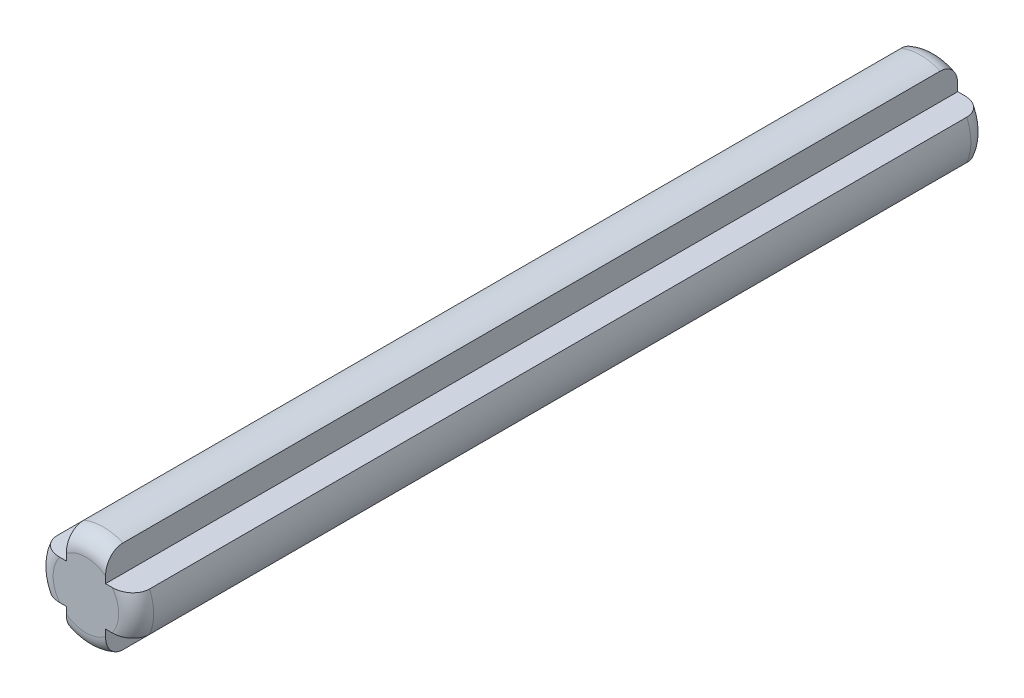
ISO-10303-21;
HEADER;
FILE_DESCRIPTION(('STEP AP214'),'2;1');
FILE_NAME('part.step','',(''),(''),'','','');
FILE_SCHEMA(('AUTOMOTIVE_DESIGN { 1 0 10303 214 1 1 1 1 }'));
ENDSEC;
DATA;
#1=APPLICATION_CONTEXT('core data for automotive mechanical design processes');
#2=APPLICATION_PROTOCOL_DEFINITION('international standard','automotive_design',2000,#1);
#3=PRODUCT_CONTEXT('',#1,'mechanical');
#4=PRODUCT('Part','Part','',(#3));
#5=PRODUCT_RELATED_PRODUCT_CATEGORY('part','',(#4));
#6=PRODUCT_DEFINITION_FORMATION('','',#4);
#7=PRODUCT_DEFINITION_CONTEXT('part definition',#1,'design');
#8=PRODUCT_DEFINITION('design','',#6,#7);
#9=PRODUCT_DEFINITION_SHAPE('','',#8);
#10=(LENGTH_UNIT() NAMED_UNIT(*) SI_UNIT(.MILLI.,.METRE.));
#11=(NAMED_UNIT(*) PLANE_ANGLE_UNIT() SI_UNIT($,.RADIAN.));
#12=(NAMED_UNIT(*) SI_UNIT($,.STERADIAN.) SOLID_ANGLE_UNIT());
#13=UNCERTAINTY_MEASURE_WITH_UNIT(LENGTH_MEASURE(1.E-05),#10,'distance_accuracy_value','');
#14=(GEOMETRIC_REPRESENTATION_CONTEXT(3) GLOBAL_UNCERTAINTY_ASSIGNED_CONTEXT((#13)) GLOBAL_UNIT_ASSIGNED_CONTEXT((#10,
#11,#12)) REPRESENTATION_CONTEXT('',''));
#15=CARTESIAN_POINT('',(0.,0.,0.));
#16=DIRECTION('',(0.,0.,1.));
#17=DIRECTION('',(1.,0.,0.));
#18=AXIS2_PLACEMENT_3D('',#15,#16,#17);
#19=CARTESIAN_POINT('',(0.899999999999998,0.,-39.));
#20=DIRECTION('',(-1.,0.,0.));
#21=DIRECTION('',(0.,0.,0.999999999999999));
#22=AXIS2_PLACEMENT_3D('',#19,#20,#21);
#23=PLANE('',#22);
#24=DIRECTION('',(0.,-1.,0.));
#25=VECTOR('',#24,1.);
#26=CARTESIAN_POINT('',(0.899999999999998,0.,-39.));
#27=LINE('',#26,#25);
#28=CARTESIAN_POINT('',(0.900000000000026,1.2,-39.));
#29=VERTEX_POINT('',#28);
#30=CARTESIAN_POINT('',(0.900000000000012,0.899999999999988,-39.));
#31=VERTEX_POINT('',#30);
#32=EDGE_CURVE('E218',#29,#31,#27,.T.);
#33=ORIENTED_EDGE('',*,*,#32,.F.);
#34=CARTESIAN_POINT('',(0.900000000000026,1.2,-39.));
#35=CARTESIAN_POINT('',(0.900000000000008,1.23177264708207,-38.9999988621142));
#36=CARTESIAN_POINT('',(0.900000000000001,1.2635373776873,-38.9987861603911));
#37=CARTESIAN_POINT('',(0.899999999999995,1.32690893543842,-38.9937439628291));
#38=CARTESIAN_POINT('',(0.899999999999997,1.35851541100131,-38.9899101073));
#39=CARTESIAN_POINT('',(0.9,1.45291091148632,-38.9741597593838));
#40=CARTESIAN_POINT('',(0.9,1.51508424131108,-38.9579921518));
#41=CARTESIAN_POINT('',(0.899999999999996,1.62122301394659,-38.9186762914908));
#42=CARTESIAN_POINT('',(0.899999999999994,1.66610240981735,-38.8979677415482));
#43=CARTESIAN_POINT('',(0.900000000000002,1.7517430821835,-38.8494286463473));
#44=CARTESIAN_POINT('',(0.900000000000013,1.79251387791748,-38.8216151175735));
#45=CARTESIAN_POINT('',(0.900000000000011,1.8687569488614,-38.7590609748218));
#46=CARTESIAN_POINT('',(0.899999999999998,1.90419849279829,-38.7242826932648));
#47=CARTESIAN_POINT('',(0.899999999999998,1.96804173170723,-38.6487024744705));
#48=CARTESIAN_POINT('',(0.900000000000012,1.99643996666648,-38.607897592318));
#49=CARTESIAN_POINT('',(0.900000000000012,2.0426342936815,-38.5255349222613));
#50=CARTESIAN_POINT('',(0.900000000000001,2.06116131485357,-38.4843855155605));
#51=CARTESIAN_POINT('',(0.899999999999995,2.09051404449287,-38.3994647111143));
#52=CARTESIAN_POINT('',(0.899999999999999,2.10135386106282,-38.3556982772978));
#53=CARTESIAN_POINT('',(0.899999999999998,2.11095369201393,-38.292930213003));
#54=CARTESIAN_POINT('',(0.899999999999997,2.11307132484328,-38.2743928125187));
#55=CARTESIAN_POINT('',(0.899999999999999,2.11589349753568,-38.2372401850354));
#56=CARTESIAN_POINT('',(0.900000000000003,2.11660026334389,-38.2186251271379));
#57=CARTESIAN_POINT('',(0.900000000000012,2.11660104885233,-38.2000000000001));
#58=B_SPLINE_CURVE_WITH_KNOTS('',3,(#34,#35,#36,#37,#38,#39,#40,#41,#42,#43,#44,#45,#46,#47,#48,
#49,#50,#51,#52,#53,#54,#55,#56,#57),.UNSPECIFIED.,.F.,.F.,(4,2,2,2,2,2,2,2,2,2,2,4),(0.,
0.0952699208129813,0.190698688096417,0.382124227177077,0.529802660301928,0.677130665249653,
0.825278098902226,0.973498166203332,1.10819470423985,1.24264339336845,1.29857368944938,
1.35441567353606),.UNSPECIFIED.);
#59=CARTESIAN_POINT('',(0.900000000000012,2.11660104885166,-38.2));
#60=VERTEX_POINT('',#59);
#61=EDGE_CURVE('E413',#29,#60,#58,.T.);
#62=ORIENTED_EDGE('',*,*,#61,.T.);
#63=DIRECTION('',(0.,0.,0.999999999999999));
#64=VECTOR('',#63,1.);
#65=CARTESIAN_POINT('',(0.900000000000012,2.11660104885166,-39.));
#66=LINE('',#65,#64);
#67=CARTESIAN_POINT('',(0.899999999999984,2.11660104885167,-0.800000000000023));
#68=VERTEX_POINT('',#67);
#69=EDGE_CURVE('E256',#60,#68,#66,.T.);
#70=ORIENTED_EDGE('',*,*,#69,.T.);
#71=CARTESIAN_POINT('',(0.899999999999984,2.11660104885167,-0.800000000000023));
#72=CARTESIAN_POINT('',(0.899999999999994,2.11664820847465,-0.757867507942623));
#73=CARTESIAN_POINT('',(0.899999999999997,2.11298761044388,-0.715759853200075));
#74=CARTESIAN_POINT('',(0.899999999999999,2.09861504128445,-0.632869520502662));
#75=CARTESIAN_POINT('',(0.899999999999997,2.08792060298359,-0.592083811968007));
#76=CARTESIAN_POINT('',(0.899999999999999,2.05984193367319,-0.512893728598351));
#77=CARTESIAN_POINT('',(0.900000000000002,2.04245802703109,-0.474489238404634));
#78=CARTESIAN_POINT('',(0.899999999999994,2.00163237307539,-0.401044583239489));
#79=CARTESIAN_POINT('',(0.899999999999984,1.97818857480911,-0.366005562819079));
#80=CARTESIAN_POINT('',(0.899999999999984,1.92541056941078,-0.299327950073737));
#81=CARTESIAN_POINT('',(0.899999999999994,1.89594969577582,-0.267789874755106));
#82=CARTESIAN_POINT('',(0.900000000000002,1.83247761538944,-0.209727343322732));
#83=CARTESIAN_POINT('',(0.9,1.7984671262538,-0.183202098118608));
#84=CARTESIAN_POINT('',(0.899999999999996,1.72434385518,-0.133829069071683));
#85=CARTESIAN_POINT('',(0.899999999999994,1.6839694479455,-0.111374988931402));
#86=CARTESIAN_POINT('',(0.900000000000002,1.60027120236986,-0.0727387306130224));
#87=CARTESIAN_POINT('',(0.900000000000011,1.55694210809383,-0.056568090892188));
#88=CARTESIAN_POINT('',(0.900000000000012,1.46195018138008,-0.028495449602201));
#89=CARTESIAN_POINT('',(0.900000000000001,1.40999804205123,-0.0175692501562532));
#90=CARTESIAN_POINT('',(0.899999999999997,1.33146710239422,-0.00688571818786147));
#91=CARTESIAN_POINT('',(0.899999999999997,1.30523100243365,-0.00427515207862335));
#92=CARTESIAN_POINT('',(0.899999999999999,1.25266468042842,-0.000833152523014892));
#93=CARTESIAN_POINT('',(0.899999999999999,1.22633456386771,-1.25965912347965E-07));
#94=CARTESIAN_POINT('',(0.899999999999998,1.19999999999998,0.));
#95=B_SPLINE_CURVE_WITH_KNOTS('',3,(#71,#72,#73,#74,#75,#76,#77,#78,#79,#80,#81,#82,#83,#84,#85,
#86,#87,#88,#89,#90,#91,#92,#93,#94),.UNSPECIFIED.,.F.,.F.,(4,2,2,2,2,2,2,2,2,2,2,4),(0.,
0.126200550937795,0.252087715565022,0.377968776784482,0.503892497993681,0.632806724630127,
0.761700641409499,0.899726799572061,1.03800523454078,1.19659344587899,1.27564166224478,
1.35461900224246),.UNSPECIFIED.);
#96=CARTESIAN_POINT('',(0.899999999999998,1.19999999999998,0.));
#97=VERTEX_POINT('',#96);
#98=EDGE_CURVE('E421',#68,#97,#95,.T.);
#99=ORIENTED_EDGE('',*,*,#98,.T.);
#100=DIRECTION('',(0.,-1.,0.));
#101=VECTOR('',#100,1.);
#102=CARTESIAN_POINT('',(0.899999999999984,0.,0.));
#103=LINE('',#102,#101);
#104=CARTESIAN_POINT('',(0.900000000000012,0.900000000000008,0.));
#105=VERTEX_POINT('',#104);
#106=EDGE_CURVE('E257',#97,#105,#103,.T.);
#107=ORIENTED_EDGE('',*,*,#106,.T.);
#108=DIRECTION('',(0.,0.,0.999999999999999));
#109=VECTOR('',#108,1.);
#110=CARTESIAN_POINT('',(0.900000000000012,0.899999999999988,-39.));
#111=LINE('',#110,#109);
#112=EDGE_CURVE('E283',#31,#105,#111,.T.);
#113=ORIENTED_EDGE('',*,*,#112,.F.);
#114=EDGE_LOOP('',(#33,#62,#70,#99,#107,#113));
#115=FACE_BOUND('',#114,.T.);
#116=ADVANCED_FACE('F59',(#115),#23,.F.);
#117=CARTESIAN_POINT('',(0.,0.899999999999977,-39.));
#118=DIRECTION('',(0.,-1.,0.));
#119=DIRECTION('',(0.,0.,-0.999999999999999));
#120=AXIS2_PLACEMENT_3D('',#117,#118,#119);
#121=PLANE('',#120);
#122=DIRECTION('',(0.,0.,0.999999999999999));
#123=VECTOR('',#122,1.);
#124=CARTESIAN_POINT('',(2.11660104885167,0.899999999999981,-39.));
#125=LINE('',#124,#123);
#126=CARTESIAN_POINT('',(2.11660104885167,0.899999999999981,-38.2));
#127=VERTEX_POINT('',#126);
#128=CARTESIAN_POINT('',(2.11660104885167,0.899999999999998,-0.800000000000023));
#129=VERTEX_POINT('',#128);
#130=EDGE_CURVE('E288',#127,#129,#125,.T.);
#131=ORIENTED_EDGE('',*,*,#130,.F.);
#132=CARTESIAN_POINT('',(2.11660104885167,0.899999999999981,-38.2));
#133=CARTESIAN_POINT('',(2.11664820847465,0.89999999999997,-38.2421324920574));
#134=CARTESIAN_POINT('',(2.11298761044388,0.899999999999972,-38.2842401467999));
#135=CARTESIAN_POINT('',(2.09861504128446,0.899999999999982,-38.3671304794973));
#136=CARTESIAN_POINT('',(2.08792060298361,0.899999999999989,-38.407916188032));
#137=CARTESIAN_POINT('',(2.05984193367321,0.899999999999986,-38.4871062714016));
#138=CARTESIAN_POINT('',(2.04245802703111,0.899999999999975,-38.5255107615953));
#139=CARTESIAN_POINT('',(2.0016323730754,0.899999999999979,-38.5989554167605));
#140=CARTESIAN_POINT('',(1.97818857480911,0.899999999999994,-38.6339944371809));
#141=CARTESIAN_POINT('',(1.92541056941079,0.899999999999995,-38.7006720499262));
#142=CARTESIAN_POINT('',(1.89594969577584,0.899999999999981,-38.7322101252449));
#143=CARTESIAN_POINT('',(1.83247761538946,0.899999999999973,-38.7902726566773));
#144=CARTESIAN_POINT('',(1.7984671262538,0.899999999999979,-38.8167979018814));
#145=CARTESIAN_POINT('',(1.72434385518,0.899999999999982,-38.8661709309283));
#146=CARTESIAN_POINT('',(1.68396944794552,0.899999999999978,-38.8886250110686));
#147=CARTESIAN_POINT('',(1.60027120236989,0.899999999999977,-38.927261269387));
#148=CARTESIAN_POINT('',(1.55694210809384,0.89999999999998,-38.9434319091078));
#149=CARTESIAN_POINT('',(1.4619501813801,0.899999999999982,-38.9715045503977));
#150=CARTESIAN_POINT('',(1.40999804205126,0.899999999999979,-38.9824307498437));
#151=CARTESIAN_POINT('',(1.33146710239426,0.899999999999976,-38.9931142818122));
#152=CARTESIAN_POINT('',(1.30523100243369,0.899999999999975,-38.9957248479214));
#153=CARTESIAN_POINT('',(1.25266468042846,0.899999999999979,-38.999166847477));
#154=CARTESIAN_POINT('',(1.22633456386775,0.899999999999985,-38.9999998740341));
#155=CARTESIAN_POINT('',(1.20000000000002,0.899999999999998,-39.));
#156=B_SPLINE_CURVE_WITH_KNOTS('',3,(#132,#133,#134,#135,#136,#137,#138,#139,#140,#141,#142,
#143,#144,#145,#146,#147,#148,#149,#150,#151,#152,#153,#154,#155),.UNSPECIFIED.,.F.,.F.,(4,2,2,
2,2,2,2,2,2,2,2,4),(0.,0.126200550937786,0.252087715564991,0.377968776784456,0.50389249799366,
0.63280672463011,0.76170064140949,0.89972679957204,1.03800523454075,1.19659344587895,
1.27564166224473,1.35461900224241),.UNSPECIFIED.);
#157=CARTESIAN_POINT('',(1.20000000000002,0.899999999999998,-39.));
#158=VERTEX_POINT('',#157);
#159=EDGE_CURVE('E339',#127,#158,#156,.T.);
#160=ORIENTED_EDGE('',*,*,#159,.T.);
#161=DIRECTION('',(1.,0.,0.));
#162=VECTOR('',#161,1.);
#163=CARTESIAN_POINT('',(0.,0.899999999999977,-39.));
#164=LINE('',#163,#162);
#165=EDGE_CURVE('E253',#31,#158,#164,.T.);
#166=ORIENTED_EDGE('',*,*,#165,.F.);
#167=ORIENTED_EDGE('',*,*,#112,.T.);
#168=DIRECTION('',(1.,0.,0.));
#169=VECTOR('',#168,1.);
#170=CARTESIAN_POINT('',(0.,0.900000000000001,0.));
#171=LINE('',#170,#169);
#172=CARTESIAN_POINT('',(1.19999999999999,0.900000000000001,0.));
#173=VERTEX_POINT('',#172);
#174=EDGE_CURVE('E279',#105,#173,#171,.T.);
#175=ORIENTED_EDGE('',*,*,#174,.T.);
#176=CARTESIAN_POINT('',(1.19999999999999,0.900000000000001,0.));
#177=CARTESIAN_POINT('',(1.23177264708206,0.899999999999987,-1.13788576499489E-06));
#178=CARTESIAN_POINT('',(1.26353737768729,0.89999999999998,-0.00121383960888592));
#179=CARTESIAN_POINT('',(1.32690893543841,0.899999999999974,-0.00625603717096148));
#180=CARTESIAN_POINT('',(1.3585154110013,0.899999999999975,-0.0100898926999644));
#181=CARTESIAN_POINT('',(1.45291091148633,0.899999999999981,-0.0258402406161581));
#182=CARTESIAN_POINT('',(1.5150842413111,0.899999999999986,-0.0420078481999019));
#183=CARTESIAN_POINT('',(1.6212230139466,0.899999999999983,-0.0813237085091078));
#184=CARTESIAN_POINT('',(1.66610240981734,0.899999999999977,-0.102032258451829));
#185=CARTESIAN_POINT('',(1.75174308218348,0.899999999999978,-0.150571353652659));
#186=CARTESIAN_POINT('',(1.79251387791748,0.899999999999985,-0.178384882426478));
#187=CARTESIAN_POINT('',(1.8687569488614,0.899999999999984,-0.24093902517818));
#188=CARTESIAN_POINT('',(1.90419849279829,0.899999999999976,-0.27571730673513));
#189=CARTESIAN_POINT('',(1.96804173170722,0.899999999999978,-0.351297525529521));
#190=CARTESIAN_POINT('',(1.99643996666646,0.899999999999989,-0.392102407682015));
#191=CARTESIAN_POINT('',(2.04263429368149,0.899999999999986,-0.474465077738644));
#192=CARTESIAN_POINT('',(2.06116131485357,0.899999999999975,-0.515614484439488));
#193=CARTESIAN_POINT('',(2.09051404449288,0.899999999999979,-0.600535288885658));
#194=CARTESIAN_POINT('',(2.10135386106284,0.899999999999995,-0.644301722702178));
#195=CARTESIAN_POINT('',(2.11095369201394,0.899999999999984,-0.707069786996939));
#196=CARTESIAN_POINT('',(2.11307132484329,0.899999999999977,-0.725607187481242));
#197=CARTESIAN_POINT('',(2.1158934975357,0.899999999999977,-0.762759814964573));
#198=CARTESIAN_POINT('',(2.11660026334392,0.899999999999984,-0.781374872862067));
#199=CARTESIAN_POINT('',(2.11660104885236,0.900000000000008,-0.799999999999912));
#200=B_SPLINE_CURVE_WITH_KNOTS('',3,(#176,#177,#178,#179,#180,#181,#182,#183,#184,#185,#186,
#187,#188,#189,#190,#191,#192,#193,#194,#195,#196,#197,#198,#199),.UNSPECIFIED.,.F.,.F.,(4,2,2,
2,2,2,2,2,2,2,2,4),(0.,0.0952699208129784,0.190698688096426,0.382124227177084,0.529802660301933,
0.677130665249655,0.825278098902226,0.973498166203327,1.10819470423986,1.24264339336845,
1.29857368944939,1.35441567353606),.UNSPECIFIED.);
#201=EDGE_CURVE('E330',#173,#129,#200,.T.);
#202=ORIENTED_EDGE('',*,*,#201,.T.);
#203=EDGE_LOOP('',(#131,#160,#166,#167,#175,#202));
#204=FACE_BOUND('',#203,.T.);
#205=ADVANCED_FACE('F349',(#204),#121,.F.);
#206=CARTESIAN_POINT('',(0.,0.,-39.));
#207=DIRECTION('',(0.,0.,0.999999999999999));
#208=DIRECTION('',(1.,0.,0.));
#209=AXIS2_PLACEMENT_3D('',#206,#207,#208);
#210=CYLINDRICAL_SURFACE('',#209,2.3);
#211=DIRECTION('',(0.,0.,0.999999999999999));
#212=VECTOR('',#211,1.);
#213=CARTESIAN_POINT('',(2.11660104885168,-0.900000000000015,-39.));
#214=LINE('',#213,#212);
#215=CARTESIAN_POINT('',(2.11660104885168,-0.900000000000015,-38.2));
#216=VERTEX_POINT('',#215);
#217=CARTESIAN_POINT('',(2.11660104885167,-0.900000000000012,-0.800000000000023));
#218=VERTEX_POINT('',#217);
#219=EDGE_CURVE('E292',#216,#218,#214,.T.);
#220=ORIENTED_EDGE('',*,*,#219,.F.);
#221=CARTESIAN_POINT('',(0.,0.,-38.2));
#222=DIRECTION('',(0.,0.,0.999999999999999));
#223=DIRECTION('',(1.,0.,0.));
#224=AXIS2_PLACEMENT_3D('',#221,#222,#223);
#225=CIRCLE('',#224,2.3);
#226=EDGE_CURVE('E326',#216,#127,#225,.T.);
#227=ORIENTED_EDGE('',*,*,#226,.T.);
#228=ORIENTED_EDGE('',*,*,#130,.T.);
#229=CARTESIAN_POINT('',(0.,0.,-0.800000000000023));
#230=DIRECTION('',(0.,0.,0.999999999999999));
#231=DIRECTION('',(1.,0.,0.));
#232=AXIS2_PLACEMENT_3D('',#229,#230,#231);
#233=CIRCLE('',#232,2.3);
#234=EDGE_CURVE('E287',#129,#218,#233,.F.);
#235=ORIENTED_EDGE('',*,*,#234,.T.);
#236=EDGE_LOOP('',(#220,#227,#228,#235));
#237=FACE_BOUND('',#236,.T.);
#238=ADVANCED_FACE('F354',(#237),#210,.T.);
#239=CARTESIAN_POINT('',(0.,-0.900000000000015,-39.));
#240=DIRECTION('',(0.,-1.,0.));
#241=DIRECTION('',(0.,0.,-0.999999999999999));
#242=AXIS2_PLACEMENT_3D('',#239,#240,#241);
#243=PLANE('',#242);
#244=DIRECTION('',(1.,0.,0.));
#245=VECTOR('',#244,1.);
#246=CARTESIAN_POINT('',(0.,-0.900000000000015,-39.));
#247=LINE('',#246,#245);
#248=CARTESIAN_POINT('',(0.899999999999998,-0.900000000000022,-39.));
#249=VERTEX_POINT('',#248);
#250=CARTESIAN_POINT('',(1.20000000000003,-0.900000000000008,-39.));
#251=VERTEX_POINT('',#250);
#252=EDGE_CURVE('E249',#249,#251,#247,.T.);
#253=ORIENTED_EDGE('',*,*,#252,.T.);
#254=CARTESIAN_POINT('',(1.20000000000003,-0.900000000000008,-39.));
#255=CARTESIAN_POINT('',(1.2317726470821,-0.900000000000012,-38.9999988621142));
#256=CARTESIAN_POINT('',(1.26353737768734,-0.900000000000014,-38.9987861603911));
#257=CARTESIAN_POINT('',(1.32690893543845,-0.900000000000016,-38.993743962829));
#258=CARTESIAN_POINT('',(1.35851541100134,-0.900000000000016,-38.9899101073));
#259=CARTESIAN_POINT('',(1.45291091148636,-0.900000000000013,-38.9741597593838));
#260=CARTESIAN_POINT('',(1.51508424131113,-0.900000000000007,-38.9579921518));
#261=CARTESIAN_POINT('',(1.62122301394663,-0.90000000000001,-38.9186762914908));
#262=CARTESIAN_POINT('',(1.66610240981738,-0.900000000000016,-38.8979677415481));
#263=CARTESIAN_POINT('',(1.75174308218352,-0.900000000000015,-38.8494286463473));
#264=CARTESIAN_POINT('',(1.79251387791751,-0.900000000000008,-38.8216151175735));
#265=CARTESIAN_POINT('',(1.86875694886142,-0.900000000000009,-38.7590609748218));
#266=CARTESIAN_POINT('',(1.9041984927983,-0.900000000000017,-38.7242826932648));
#267=CARTESIAN_POINT('',(1.96804173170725,-0.900000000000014,-38.6487024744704));
#268=CARTESIAN_POINT('',(1.99643996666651,-0.900000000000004,-38.607897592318));
#269=CARTESIAN_POINT('',(2.04263429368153,-0.900000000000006,-38.5255349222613));
#270=CARTESIAN_POINT('',(2.06116131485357,-0.900000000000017,-38.4843855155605));
#271=CARTESIAN_POINT('',(2.09051404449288,-0.900000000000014,-38.3994647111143));
#272=CARTESIAN_POINT('',(2.10135386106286,-0.9,-38.3556982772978));
#273=CARTESIAN_POINT('',(2.11095369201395,-0.900000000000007,-38.292930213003));
#274=CARTESIAN_POINT('',(2.11307132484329,-0.900000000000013,-38.2743928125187));
#275=CARTESIAN_POINT('',(2.11589349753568,-0.900000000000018,-38.2372401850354));
#276=CARTESIAN_POINT('',(2.1166002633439,-0.900000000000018,-38.2186251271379));
#277=CARTESIAN_POINT('',(2.11660104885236,-0.900000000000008,-38.2000000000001));
#278=B_SPLINE_CURVE_WITH_KNOTS('',3,(#254,#255,#256,#257,#258,#259,#260,#261,#262,#263,#264,
#265,#266,#267,#268,#269,#270,#271,#272,#273,#274,#275,#276,#277),.UNSPECIFIED.,.F.,.F.,(4,2,2,
2,2,2,2,2,2,2,2,4),(0.,0.0952699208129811,0.190698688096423,0.382124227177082,0.529802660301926,
0.677130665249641,0.825278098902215,0.973498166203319,1.10819470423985,1.24264339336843,
1.29857368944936,1.35441567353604),.UNSPECIFIED.);
#279=EDGE_CURVE('E380',#251,#216,#278,.T.);
#280=ORIENTED_EDGE('',*,*,#279,.T.);
#281=ORIENTED_EDGE('',*,*,#219,.T.);
#282=CARTESIAN_POINT('',(2.11660104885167,-0.900000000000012,-0.800000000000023));
#283=CARTESIAN_POINT('',(2.11664820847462,-0.900000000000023,-0.757867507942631));
#284=CARTESIAN_POINT('',(2.11298761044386,-0.90000000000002,-0.71575985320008));
#285=CARTESIAN_POINT('',(2.09861504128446,-0.90000000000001,-0.632869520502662));
#286=CARTESIAN_POINT('',(2.08792060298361,-0.900000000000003,-0.592083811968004));
#287=CARTESIAN_POINT('',(2.05984193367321,-0.900000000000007,-0.512893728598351));
#288=CARTESIAN_POINT('',(2.04245802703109,-0.900000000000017,-0.474489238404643));
#289=CARTESIAN_POINT('',(2.00163237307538,-0.900000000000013,-0.401044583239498));
#290=CARTESIAN_POINT('',(1.97818857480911,-0.899999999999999,-0.366005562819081));
#291=CARTESIAN_POINT('',(1.92541056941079,-0.899999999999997,-0.299327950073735));
#292=CARTESIAN_POINT('',(1.89594969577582,-0.900000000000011,-0.267789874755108));
#293=CARTESIAN_POINT('',(1.83247761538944,-0.90000000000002,-0.209727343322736));
#294=CARTESIAN_POINT('',(1.7984671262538,-0.900000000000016,-0.183202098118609));
#295=CARTESIAN_POINT('',(1.72434385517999,-0.900000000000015,-0.133829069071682));
#296=CARTESIAN_POINT('',(1.68396944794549,-0.900000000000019,-0.111374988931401));
#297=CARTESIAN_POINT('',(1.60027120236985,-0.900000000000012,-0.0727387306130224));
#298=CARTESIAN_POINT('',(1.55694210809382,-0.900000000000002,-0.0565680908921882));
#299=CARTESIAN_POINT('',(1.46195018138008,-0.9,-0.0284954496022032));
#300=CARTESIAN_POINT('',(1.40999804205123,-0.900000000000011,-0.0175692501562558));
#301=CARTESIAN_POINT('',(1.33146710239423,-0.900000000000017,-0.00688571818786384));
#302=CARTESIAN_POINT('',(1.30523100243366,-0.900000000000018,-0.00427515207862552));
#303=CARTESIAN_POINT('',(1.25266468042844,-0.900000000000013,-0.000833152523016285));
#304=CARTESIAN_POINT('',(1.22633456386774,-0.900000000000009,-1.25965913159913E-07));
#305=CARTESIAN_POINT('',(1.20000000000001,-0.900000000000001,0.));
#306=B_SPLINE_CURVE_WITH_KNOTS('',3,(#282,#283,#284,#285,#286,#287,#288,#289,#290,#291,#292,
#293,#294,#295,#296,#297,#298,#299,#300,#301,#302,#303,#304,#305),.UNSPECIFIED.,.F.,.F.,(4,2,2,
2,2,2,2,2,2,2,2,4),(0.,0.126200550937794,0.252087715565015,0.377968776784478,0.503892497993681,
0.632806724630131,0.761700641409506,0.89972679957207,1.03800523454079,1.19659344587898,
1.27564166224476,1.35461900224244),.UNSPECIFIED.);
#307=CARTESIAN_POINT('',(1.20000000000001,-0.900000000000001,0.));
#308=VERTEX_POINT('',#307);
#309=EDGE_CURVE('E373',#218,#308,#306,.T.);
#310=ORIENTED_EDGE('',*,*,#309,.T.);
#311=DIRECTION('',(1.,0.,0.));
#312=VECTOR('',#311,1.);
#313=CARTESIAN_POINT('',(0.,-0.900000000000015,0.));
#314=LINE('',#313,#312);
#315=CARTESIAN_POINT('',(0.899999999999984,-0.900000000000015,0.));
#316=VERTEX_POINT('',#315);
#317=EDGE_CURVE('E275',#316,#308,#314,.T.);
#318=ORIENTED_EDGE('',*,*,#317,.F.);
#319=DIRECTION('',(0.,0.,0.999999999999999));
#320=VECTOR('',#319,1.);
#321=CARTESIAN_POINT('',(0.899999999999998,-0.900000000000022,-39.));
#322=LINE('',#321,#320);
#323=EDGE_CURVE('E296',#249,#316,#322,.T.);
#324=ORIENTED_EDGE('',*,*,#323,.F.);
#325=EDGE_LOOP('',(#253,#280,#281,#310,#318,#324));
#326=FACE_BOUND('',#325,.T.);
#327=ADVANCED_FACE('F361',(#326),#243,.T.);
#328=CARTESIAN_POINT('',(0.899999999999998,0.,-39.));
#329=DIRECTION('',(1.,0.,0.));
#330=DIRECTION('',(0.,0.,-0.999999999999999));
#331=AXIS2_PLACEMENT_3D('',#328,#329,#330);
#332=PLANE('',#331);
#333=DIRECTION('',(0.,0.,0.999999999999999));
#334=VECTOR('',#333,1.);
#335=CARTESIAN_POINT('',(0.900000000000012,-2.11660104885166,-39.));
#336=LINE('',#335,#334);
#337=CARTESIAN_POINT('',(0.900000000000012,-2.11660104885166,-38.2));
#338=VERTEX_POINT('',#337);
#339=CARTESIAN_POINT('',(0.900000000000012,-2.11660104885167,-0.800000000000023));
#340=VERTEX_POINT('',#339);
#341=EDGE_CURVE('E300',#338,#340,#336,.T.);
#342=ORIENTED_EDGE('',*,*,#341,.F.);
#343=CARTESIAN_POINT('',(0.900000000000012,-2.11660104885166,-38.2));
#344=CARTESIAN_POINT('',(0.899999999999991,-2.11664820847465,-38.2421324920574));
#345=CARTESIAN_POINT('',(0.899999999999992,-2.11298761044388,-38.2842401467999));
#346=CARTESIAN_POINT('',(0.900000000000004,-2.09861504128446,-38.3671304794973));
#347=CARTESIAN_POINT('',(0.900000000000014,-2.08792060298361,-38.407916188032));
#348=CARTESIAN_POINT('',(0.900000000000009,-2.05984193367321,-38.4871062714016));
#349=CARTESIAN_POINT('',(0.899999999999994,-2.04245802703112,-38.5255107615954));
#350=CARTESIAN_POINT('',(0.900000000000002,-2.0016323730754,-38.5989554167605));
#351=CARTESIAN_POINT('',(0.900000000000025,-1.97818857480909,-38.6339944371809));
#352=CARTESIAN_POINT('',(0.900000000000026,-1.92541056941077,-38.7006720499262));
#353=CARTESIAN_POINT('',(0.900000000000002,-1.89594969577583,-38.7322101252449));
#354=CARTESIAN_POINT('',(0.899999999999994,-1.83247761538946,-38.7902726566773));
#355=CARTESIAN_POINT('',(0.900000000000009,-1.7984671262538,-38.8167979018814));
#356=CARTESIAN_POINT('',(0.900000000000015,-1.72434385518,-38.8661709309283));
#357=CARTESIAN_POINT('',(0.900000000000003,-1.68396944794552,-38.8886250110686));
#358=CARTESIAN_POINT('',(0.899999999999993,-1.60027120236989,-38.927261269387));
#359=CARTESIAN_POINT('',(0.899999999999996,-1.55694210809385,-38.9434319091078));
#360=CARTESIAN_POINT('',(0.9,-1.46195018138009,-38.9715045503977));
#361=CARTESIAN_POINT('',(0.9,-1.40999804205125,-38.9824307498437));
#362=CARTESIAN_POINT('',(0.899999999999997,-1.33146710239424,-38.9931142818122));
#363=CARTESIAN_POINT('',(0.899999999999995,-1.30523100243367,-38.9957248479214));
#364=CARTESIAN_POINT('',(0.900000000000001,-1.25266468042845,-38.999166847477));
#365=CARTESIAN_POINT('',(0.900000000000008,-1.22633456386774,-38.9999998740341));
#366=CARTESIAN_POINT('',(0.900000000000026,-1.2,-39.));
#367=B_SPLINE_CURVE_WITH_KNOTS('',3,(#343,#344,#345,#346,#347,#348,#349,#350,#351,#352,#353,
#354,#355,#356,#357,#358,#359,#360,#361,#362,#363,#364,#365,#366),.UNSPECIFIED.,.F.,.F.,(4,2,2,
2,2,2,2,2,2,2,2,4),(0.,0.126200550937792,0.25208771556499,0.377968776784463,0.503892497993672,
0.632806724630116,0.761700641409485,0.899726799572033,1.03800523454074,1.19659344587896,
1.27564166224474,1.35461900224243),.UNSPECIFIED.);
#368=CARTESIAN_POINT('',(0.900000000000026,-1.2,-39.));
#369=VERTEX_POINT('',#368);
#370=EDGE_CURVE('E90',#338,#369,#367,.T.);
#371=ORIENTED_EDGE('',*,*,#370,.T.);
#372=DIRECTION('',(0.,1.,0.));
#373=VECTOR('',#372,1.);
#374=CARTESIAN_POINT('',(0.899999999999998,0.,-39.));
#375=LINE('',#374,#373);
#376=EDGE_CURVE('E246',#369,#249,#375,.T.);
#377=ORIENTED_EDGE('',*,*,#376,.T.);
#378=ORIENTED_EDGE('',*,*,#323,.T.);
#379=DIRECTION('',(0.,1.,0.));
#380=VECTOR('',#379,1.);
#381=CARTESIAN_POINT('',(0.899999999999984,0.,0.));
#382=LINE('',#381,#380);
#383=CARTESIAN_POINT('',(0.900000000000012,-1.2,0.));
#384=VERTEX_POINT('',#383);
#385=EDGE_CURVE('E272',#384,#316,#382,.T.);
#386=ORIENTED_EDGE('',*,*,#385,.F.);
#387=CARTESIAN_POINT('',(0.900000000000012,-1.2,0.));
#388=CARTESIAN_POINT('',(0.900000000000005,-1.23177264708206,-1.13788576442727E-06));
#389=CARTESIAN_POINT('',(0.9,-1.2635373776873,-0.00121383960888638));
#390=CARTESIAN_POINT('',(0.899999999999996,-1.32690893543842,-0.00625603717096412));
#391=CARTESIAN_POINT('',(0.899999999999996,-1.35851541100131,-0.0100898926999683));
#392=CARTESIAN_POINT('',(0.900000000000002,-1.45291091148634,-0.0258402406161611));
#393=CARTESIAN_POINT('',(0.900000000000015,-1.51508424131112,-0.042007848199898));
#394=CARTESIAN_POINT('',(0.90000000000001,-1.62122301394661,-0.0813237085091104));
#395=CARTESIAN_POINT('',(0.899999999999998,-1.66610240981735,-0.102032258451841));
#396=CARTESIAN_POINT('',(0.899999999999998,-1.75174308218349,-0.150571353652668));
#397=CARTESIAN_POINT('',(0.900000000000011,-1.7925138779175,-0.178384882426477));
#398=CARTESIAN_POINT('',(0.900000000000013,-1.86875694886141,-0.240939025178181));
#399=CARTESIAN_POINT('',(0.900000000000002,-1.90419849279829,-0.275717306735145));
#400=CARTESIAN_POINT('',(0.899999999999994,-1.96804173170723,-0.351297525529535));
#401=CARTESIAN_POINT('',(0.899999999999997,-1.9964399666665,-0.392102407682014));
#402=CARTESIAN_POINT('',(0.899999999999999,-2.04263429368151,-0.474465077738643));
#403=CARTESIAN_POINT('',(0.899999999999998,-2.06116131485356,-0.515614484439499));
#404=CARTESIAN_POINT('',(0.899999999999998,-2.09051404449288,-0.600535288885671));
#405=CARTESIAN_POINT('',(0.899999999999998,-2.10135386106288,-0.644301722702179));
#406=CARTESIAN_POINT('',(0.899999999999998,-2.11095369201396,-0.707069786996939));
#407=CARTESIAN_POINT('',(0.899999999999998,-2.1130713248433,-0.725607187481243));
#408=CARTESIAN_POINT('',(0.899999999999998,-2.11589349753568,-0.762759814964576));
#409=CARTESIAN_POINT('',(0.899999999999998,-2.11660026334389,-0.78137487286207));
#410=CARTESIAN_POINT('',(0.899999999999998,-2.11660104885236,-0.799999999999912));
#411=B_SPLINE_CURVE_WITH_KNOTS('',3,(#387,#388,#389,#390,#391,#392,#393,#394,#395,#396,#397,
#398,#399,#400,#401,#402,#403,#404,#405,#406,#407,#408,#409,#410),.UNSPECIFIED.,.F.,.F.,(4,2,2,
2,2,2,2,2,2,2,2,4),(0.,0.0952699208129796,0.190698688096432,0.382124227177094,0.529802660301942,
0.677130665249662,0.825278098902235,0.973498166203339,1.10819470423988,1.24264339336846,
1.29857368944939,1.35441567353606),.UNSPECIFIED.);
#412=EDGE_CURVE('E82',#384,#340,#411,.T.);
#413=ORIENTED_EDGE('',*,*,#412,.T.);
#414=EDGE_LOOP('',(#342,#371,#377,#378,#386,#413));
#415=FACE_BOUND('',#414,.T.);
#416=ADVANCED_FACE('F368',(#415),#332,.T.);
#417=DIRECTION('',(0.,0.,0.999999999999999));
#418=VECTOR('',#417,1.);
#419=CARTESIAN_POINT('',(-0.899999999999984,-2.11660104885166,-39.));
#420=LINE('',#419,#418);
#421=CARTESIAN_POINT('',(-0.899999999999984,-2.11660104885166,-38.2));
#422=VERTEX_POINT('',#421);
#423=CARTESIAN_POINT('',(-0.899999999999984,-2.11660104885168,-0.800000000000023));
#424=VERTEX_POINT('',#423);
#425=EDGE_CURVE('E303',#422,#424,#420,.T.);
#426=ORIENTED_EDGE('',*,*,#425,.F.);
#427=CARTESIAN_POINT('',(0.,0.,-38.2));
#428=DIRECTION('',(0.,0.,0.999999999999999));
#429=DIRECTION('',(1.,0.,0.));
#430=AXIS2_PLACEMENT_3D('',#427,#428,#429);
#431=CIRCLE('',#430,2.3);
#432=EDGE_CURVE('E494',#422,#338,#431,.T.);
#433=ORIENTED_EDGE('',*,*,#432,.T.);
#434=ORIENTED_EDGE('',*,*,#341,.T.);
#435=CARTESIAN_POINT('',(0.,0.,-0.800000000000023));
#436=DIRECTION('',(0.,0.,0.999999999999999));
#437=DIRECTION('',(1.,0.,0.));
#438=AXIS2_PLACEMENT_3D('',#435,#436,#437);
#439=CIRCLE('',#438,2.3);
#440=EDGE_CURVE('E491',#340,#424,#439,.F.);
#441=ORIENTED_EDGE('',*,*,#440,.T.);
#442=EDGE_LOOP('',(#426,#433,#434,#441));
#443=FACE_BOUND('',#442,.T.);
#444=ADVANCED_FACE('F364',(#443),#210,.T.);
#445=CARTESIAN_POINT('',(-0.899999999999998,0.,-39.));
#446=DIRECTION('',(1.,0.,0.));
#447=DIRECTION('',(0.,0.,-0.999999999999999));
#448=AXIS2_PLACEMENT_3D('',#445,#446,#447);
#449=PLANE('',#448);
#450=DIRECTION('',(0.,1.,0.));
#451=VECTOR('',#450,1.);
#452=CARTESIAN_POINT('',(-0.899999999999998,0.,-39.));
#453=LINE('',#452,#451);
#454=CARTESIAN_POINT('',(-0.899999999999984,-1.20000000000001,-39.));
#455=VERTEX_POINT('',#454);
#456=CARTESIAN_POINT('',(-0.899999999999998,-0.900000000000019,-39.));
#457=VERTEX_POINT('',#456);
#458=EDGE_CURVE('E240',#455,#457,#453,.T.);
#459=ORIENTED_EDGE('',*,*,#458,.F.);
#460=CARTESIAN_POINT('',(-0.899999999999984,-1.20000000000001,-39.));
#461=CARTESIAN_POINT('',(-0.899999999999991,-1.23177264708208,-38.9999988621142));
#462=CARTESIAN_POINT('',(-0.899999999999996,-1.26353737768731,-38.9987861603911));
#463=CARTESIAN_POINT('',(-0.9,-1.32690893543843,-38.9937439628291));
#464=CARTESIAN_POINT('',(-0.9,-1.35851541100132,-38.9899101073));
#465=CARTESIAN_POINT('',(-0.899999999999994,-1.45291091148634,-38.9741597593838));
#466=CARTESIAN_POINT('',(-0.899999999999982,-1.5150842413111,-38.9579921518));
#467=CARTESIAN_POINT('',(-0.899999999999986,-1.62122301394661,-38.9186762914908));
#468=CARTESIAN_POINT('',(-0.899999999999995,-1.66610240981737,-38.8979677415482));
#469=CARTESIAN_POINT('',(-0.900000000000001,-1.75174308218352,-38.8494286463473));
#470=CARTESIAN_POINT('',(-0.899999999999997,-1.79251387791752,-38.8216151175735));
#471=CARTESIAN_POINT('',(-0.899999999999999,-1.86875694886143,-38.7590609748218));
#472=CARTESIAN_POINT('',(-0.900000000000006,-1.90419849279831,-38.7242826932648));
#473=CARTESIAN_POINT('',(-0.89999999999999,-1.96804173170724,-38.6487024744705));
#474=CARTESIAN_POINT('',(-0.899999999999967,-1.99643996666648,-38.607897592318));
#475=CARTESIAN_POINT('',(-0.899999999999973,-2.0426342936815,-38.5255349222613));
#476=CARTESIAN_POINT('',(-0.899999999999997,-2.06116131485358,-38.4843855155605));
#477=CARTESIAN_POINT('',(-0.899999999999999,-2.09051404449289,-38.3994647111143));
#478=CARTESIAN_POINT('',(-0.899999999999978,-2.10135386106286,-38.3556982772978));
#479=CARTESIAN_POINT('',(-0.899999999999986,-2.11095369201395,-38.292930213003));
#480=CARTESIAN_POINT('',(-0.899999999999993,-2.1130713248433,-38.2743928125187));
#481=CARTESIAN_POINT('',(-0.900000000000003,-2.1158934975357,-38.2372401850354));
#482=CARTESIAN_POINT('',(-0.900000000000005,-2.11660026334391,-38.2186251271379));
#483=CARTESIAN_POINT('',(-0.899999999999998,-2.11660104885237,-38.2000000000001));
#484=B_SPLINE_CURVE_WITH_KNOTS('',3,(#460,#461,#462,#463,#464,#465,#466,#467,#468,#469,#470,
#471,#472,#473,#474,#475,#476,#477,#478,#479,#480,#481,#482,#483),.UNSPECIFIED.,.F.,.F.,(4,2,2,
2,2,2,2,2,2,2,2,4),(0.,0.0952699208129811,0.190698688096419,0.382124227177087,0.529802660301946,
0.677130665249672,0.825278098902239,0.97349816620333,1.10819470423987,1.24264339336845,
1.29857368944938,1.35441567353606),.UNSPECIFIED.);
#485=EDGE_CURVE('E13',#455,#422,#484,.T.);
#486=ORIENTED_EDGE('',*,*,#485,.T.);
#487=ORIENTED_EDGE('',*,*,#425,.T.);
#488=CARTESIAN_POINT('',(-0.899999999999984,-2.11660104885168,-0.800000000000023));
#489=CARTESIAN_POINT('',(-0.900000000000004,-2.11664820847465,-0.757867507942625));
#490=CARTESIAN_POINT('',(-0.900000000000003,-2.11298761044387,-0.715759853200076));
#491=CARTESIAN_POINT('',(-0.899999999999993,-2.09861504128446,-0.632869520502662));
#492=CARTESIAN_POINT('',(-0.899999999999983,-2.0879206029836,-0.592083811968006));
#493=CARTESIAN_POINT('',(-0.899999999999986,-2.0598419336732,-0.51289372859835));
#494=CARTESIAN_POINT('',(-0.899999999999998,-2.04245802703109,-0.474489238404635));
#495=CARTESIAN_POINT('',(-0.899999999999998,-2.00163237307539,-0.401044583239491));
#496=CARTESIAN_POINT('',(-0.899999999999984,-1.97818857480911,-0.36600556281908));
#497=CARTESIAN_POINT('',(-0.899999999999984,-1.92541056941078,-0.299327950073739));
#498=CARTESIAN_POINT('',(-0.899999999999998,-1.89594969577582,-0.267789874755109));
#499=CARTESIAN_POINT('',(-0.899999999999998,-1.83247761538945,-0.209727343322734));
#500=CARTESIAN_POINT('',(-0.899999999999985,-1.79846712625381,-0.183202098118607));
#501=CARTESIAN_POINT('',(-0.899999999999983,-1.72434385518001,-0.13382906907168));
#502=CARTESIAN_POINT('',(-0.899999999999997,-1.68396944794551,-0.111374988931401));
#503=CARTESIAN_POINT('',(-0.899999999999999,-1.60027120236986,-0.0727387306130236));
#504=CARTESIAN_POINT('',(-0.899999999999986,-1.55694210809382,-0.0565680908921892));
#505=CARTESIAN_POINT('',(-0.899999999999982,-1.46195018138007,-0.0284954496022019));
#506=CARTESIAN_POINT('',(-0.899999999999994,-1.40999804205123,-0.0175692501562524));
#507=CARTESIAN_POINT('',(-0.9,-1.33146710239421,-0.00688571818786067));
#508=CARTESIAN_POINT('',(-0.9,-1.30523100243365,-0.00427515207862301));
#509=CARTESIAN_POINT('',(-0.899999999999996,-1.25266468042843,-0.000833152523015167));
#510=CARTESIAN_POINT('',(-0.899999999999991,-1.22633456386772,-1.25965912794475E-07));
#511=CARTESIAN_POINT('',(-0.899999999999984,-1.19999999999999,0.));
#512=B_SPLINE_CURVE_WITH_KNOTS('',3,(#488,#489,#490,#491,#492,#493,#494,#495,#496,#497,#498,
#499,#500,#501,#502,#503,#504,#505,#506,#507,#508,#509,#510,#511),.UNSPECIFIED.,.F.,.F.,(4,2,2,
2,2,2,2,2,2,2,2,4),(0.,0.126200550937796,0.25208771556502,0.377968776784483,0.503892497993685,
0.632806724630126,0.76170064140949,0.899726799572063,1.0380052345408,1.196593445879,
1.27564166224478,1.35461900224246),.UNSPECIFIED.);
#513=CARTESIAN_POINT('',(-0.899999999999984,-1.19999999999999,0.));
#514=VERTEX_POINT('',#513);
#515=EDGE_CURVE('E75',#424,#514,#512,.T.);
#516=ORIENTED_EDGE('',*,*,#515,.T.);
#517=DIRECTION('',(0.,1.,0.));
#518=VECTOR('',#517,1.);
#519=CARTESIAN_POINT('',(-0.900000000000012,0.,0.));
#520=LINE('',#519,#518);
#521=CARTESIAN_POINT('',(-0.900000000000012,-0.899999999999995,0.));
#522=VERTEX_POINT('',#521);
#523=EDGE_CURVE('E269',#514,#522,#520,.T.);
#524=ORIENTED_EDGE('',*,*,#523,.T.);
#525=DIRECTION('',(0.,0.,0.999999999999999));
#526=VECTOR('',#525,1.);
#527=CARTESIAN_POINT('',(-0.899999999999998,-0.900000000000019,-39.));
#528=LINE('',#527,#526);
#529=EDGE_CURVE('E307',#457,#522,#528,.T.);
#530=ORIENTED_EDGE('',*,*,#529,.F.);
#531=EDGE_LOOP('',(#459,#486,#487,#516,#524,#530));
#532=FACE_BOUND('',#531,.T.);
#533=ADVANCED_FACE('F454',(#532),#449,.F.);
#534=CARTESIAN_POINT('',(0.,-0.900000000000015,-39.));
#535=DIRECTION('',(0.,1.,0.));
#536=DIRECTION('',(0.,0.,0.999999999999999));
#537=AXIS2_PLACEMENT_3D('',#534,#535,#536);
#538=PLANE('',#537);
#539=DIRECTION('',(0.,0.,0.999999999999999));
#540=VECTOR('',#539,1.);
#541=CARTESIAN_POINT('',(-2.11660104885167,-0.900000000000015,-39.));
#542=LINE('',#541,#540);
#543=CARTESIAN_POINT('',(-2.11660104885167,-0.900000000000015,-38.2));
#544=VERTEX_POINT('',#543);
#545=CARTESIAN_POINT('',(-2.11660104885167,-0.900000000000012,-0.800000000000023));
#546=VERTEX_POINT('',#545);
#547=EDGE_CURVE('E311',#544,#546,#542,.T.);
#548=ORIENTED_EDGE('',*,*,#547,.F.);
#549=CARTESIAN_POINT('',(-2.11660104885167,-0.900000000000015,-38.2));
#550=CARTESIAN_POINT('',(-2.11664820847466,-0.900000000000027,-38.2421324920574));
#551=CARTESIAN_POINT('',(-2.11298761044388,-0.900000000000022,-38.2842401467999));
#552=CARTESIAN_POINT('',(-2.09861504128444,-0.900000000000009,-38.3671304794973));
#553=CARTESIAN_POINT('',(-2.08792060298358,-0.9,-38.407916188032));
#554=CARTESIAN_POINT('',(-2.05984193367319,-0.900000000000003,-38.4871062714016));
#555=CARTESIAN_POINT('',(-2.0424580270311,-0.900000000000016,-38.5255107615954));
#556=CARTESIAN_POINT('',(-2.00163237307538,-0.900000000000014,-38.5989554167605));
#557=CARTESIAN_POINT('',(-1.97818857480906,-0.899999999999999,-38.6339944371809));
#558=CARTESIAN_POINT('',(-1.92541056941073,-0.899999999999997,-38.7006720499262));
#559=CARTESIAN_POINT('',(-1.8959496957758,-0.900000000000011,-38.7322101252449));
#560=CARTESIAN_POINT('',(-1.83247761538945,-0.90000000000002,-38.7902726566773));
#561=CARTESIAN_POINT('',(-1.79846712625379,-0.900000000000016,-38.8167979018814));
#562=CARTESIAN_POINT('',(-1.72434385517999,-0.900000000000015,-38.8661709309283));
#563=CARTESIAN_POINT('',(-1.68396944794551,-0.900000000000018,-38.8886250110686));
#564=CARTESIAN_POINT('',(-1.60027120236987,-0.900000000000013,-38.927261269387));
#565=CARTESIAN_POINT('',(-1.55694210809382,-0.900000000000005,-38.9434319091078));
#566=CARTESIAN_POINT('',(-1.46195018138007,-0.900000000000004,-38.9715045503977));
#567=CARTESIAN_POINT('',(-1.40999804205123,-0.900000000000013,-38.9824307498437));
#568=CARTESIAN_POINT('',(-1.33146710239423,-0.900000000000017,-38.9931142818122));
#569=CARTESIAN_POINT('',(-1.30523100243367,-0.900000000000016,-38.9957248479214));
#570=CARTESIAN_POINT('',(-1.25266468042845,-0.900000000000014,-38.999166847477));
#571=CARTESIAN_POINT('',(-1.22633456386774,-0.900000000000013,-38.9999998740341));
#572=CARTESIAN_POINT('',(-1.20000000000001,-0.900000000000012,-39.));
#573=B_SPLINE_CURVE_WITH_KNOTS('',3,(#549,#550,#551,#552,#553,#554,#555,#556,#557,#558,#559,
#560,#561,#562,#563,#564,#565,#566,#567,#568,#569,#570,#571,#572),.UNSPECIFIED.,.F.,.F.,(4,2,2,
2,2,2,2,2,2,2,2,4),(0.,0.126200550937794,0.252087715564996,0.37796877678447,0.503892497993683,
0.63280672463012,0.761700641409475,0.899726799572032,1.03800523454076,1.19659344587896,
1.27564166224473,1.35461900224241),.UNSPECIFIED.);
#574=CARTESIAN_POINT('',(-1.20000000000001,-0.900000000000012,-39.));
#575=VERTEX_POINT('',#574);
#576=EDGE_CURVE('E440',#544,#575,#573,.T.);
#577=ORIENTED_EDGE('',*,*,#576,.T.);
#578=DIRECTION('',(-1.,0.,0.));
#579=VECTOR('',#578,1.);
#580=CARTESIAN_POINT('',(0.,-0.900000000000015,-39.));
#581=LINE('',#580,#579);
#582=EDGE_CURVE('E236',#457,#575,#581,.T.);
#583=ORIENTED_EDGE('',*,*,#582,.F.);
#584=ORIENTED_EDGE('',*,*,#529,.T.);
#585=DIRECTION('',(-1.,0.,0.));
#586=VECTOR('',#585,1.);
#587=CARTESIAN_POINT('',(0.,-0.900000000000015,0.));
#588=LINE('',#587,#586);
#589=CARTESIAN_POINT('',(-1.20000000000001,-0.900000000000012,0.));
#590=VERTEX_POINT('',#589);
#591=EDGE_CURVE('E265',#522,#590,#588,.T.);
#592=ORIENTED_EDGE('',*,*,#591,.T.);
#593=CARTESIAN_POINT('',(-1.20000000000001,-0.900000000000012,0.));
#594=CARTESIAN_POINT('',(-1.23177264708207,-0.900000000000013,-1.13788576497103E-06));
#595=CARTESIAN_POINT('',(-1.26353737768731,-0.900000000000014,-0.00121383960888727));
#596=CARTESIAN_POINT('',(-1.32690893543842,-0.900000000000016,-0.00625603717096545));
#597=CARTESIAN_POINT('',(-1.35851541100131,-0.900000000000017,-0.0100898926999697));
#598=CARTESIAN_POINT('',(-1.45291091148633,-0.900000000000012,-0.0258402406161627));
#599=CARTESIAN_POINT('',(-1.51508424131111,-0.9,-0.0420078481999));
#600=CARTESIAN_POINT('',(-1.6212230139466,-0.900000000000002,-0.0813237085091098));
#601=CARTESIAN_POINT('',(-1.66610240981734,-0.900000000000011,-0.102032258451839));
#602=CARTESIAN_POINT('',(-1.75174308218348,-0.900000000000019,-0.150571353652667));
#603=CARTESIAN_POINT('',(-1.79251387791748,-0.900000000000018,-0.178384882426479));
#604=CARTESIAN_POINT('',(-1.8687569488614,-0.900000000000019,-0.240939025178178));
#605=CARTESIAN_POINT('',(-1.90419849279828,-0.900000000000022,-0.275717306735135));
#606=CARTESIAN_POINT('',(-1.96804173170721,-0.900000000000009,-0.351297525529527));
#607=CARTESIAN_POINT('',(-1.99643996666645,-0.899999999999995,-0.392102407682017));
#608=CARTESIAN_POINT('',(-2.04263429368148,-0.900000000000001,-0.474465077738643));
#609=CARTESIAN_POINT('',(-2.06116131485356,-0.900000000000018,-0.515614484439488));
#610=CARTESIAN_POINT('',(-2.09051404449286,-0.900000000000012,-0.600535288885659));
#611=CARTESIAN_POINT('',(-2.10135386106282,-0.899999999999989,-0.644301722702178));
#612=CARTESIAN_POINT('',(-2.11095369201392,-0.900000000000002,-0.707069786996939));
#613=CARTESIAN_POINT('',(-2.11307132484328,-0.900000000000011,-0.725607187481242));
#614=CARTESIAN_POINT('',(-2.11589349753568,-0.900000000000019,-0.762759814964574));
#615=CARTESIAN_POINT('',(-2.1166002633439,-0.900000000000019,-0.781374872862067));
#616=CARTESIAN_POINT('',(-2.11660104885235,-0.900000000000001,-0.799999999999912));
#617=B_SPLINE_CURVE_WITH_KNOTS('',3,(#593,#594,#595,#596,#597,#598,#599,#600,#601,#602,#603,
#604,#605,#606,#607,#608,#609,#610,#611,#612,#613,#614,#615,#616),.UNSPECIFIED.,.F.,.F.,(4,2,2,
2,2,2,2,2,2,2,2,4),(0.,0.0952699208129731,0.190698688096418,0.38212422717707,0.529802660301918,
0.677130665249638,0.825278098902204,0.9734981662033,1.10819470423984,1.24264339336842,
1.29857368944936,1.35441567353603),.UNSPECIFIED.);
#618=EDGE_CURVE('E432',#590,#546,#617,.T.);
#619=ORIENTED_EDGE('',*,*,#618,.T.);
#620=EDGE_LOOP('',(#548,#577,#583,#584,#592,#619));
#621=FACE_BOUND('',#620,.T.);
#622=ADVANCED_FACE('F449',(#621),#538,.F.);
#623=DIRECTION('',(0.,0.,0.999999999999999));
#624=VECTOR('',#623,1.);
#625=CARTESIAN_POINT('',(-2.11660104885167,0.899999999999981,-39.));
#626=LINE('',#625,#624);
#627=CARTESIAN_POINT('',(-2.11660104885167,0.899999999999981,-38.2));
#628=VERTEX_POINT('',#627);
#629=CARTESIAN_POINT('',(-2.11660104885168,0.899999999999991,-0.800000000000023));
#630=VERTEX_POINT('',#629);
#631=EDGE_CURVE('E227',#628,#630,#626,.T.);
#632=ORIENTED_EDGE('',*,*,#631,.F.);
#633=CARTESIAN_POINT('',(0.,0.,-38.2));
#634=DIRECTION('',(0.,0.,0.999999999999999));
#635=DIRECTION('',(1.,0.,0.));
#636=AXIS2_PLACEMENT_3D('',#633,#634,#635);
#637=CIRCLE('',#636,2.3);
#638=EDGE_CURVE('E428',#628,#544,#637,.T.);
#639=ORIENTED_EDGE('',*,*,#638,.T.);
#640=ORIENTED_EDGE('',*,*,#547,.T.);
#641=CARTESIAN_POINT('',(0.,0.,-0.800000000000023));
#642=DIRECTION('',(0.,0.,0.999999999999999));
#643=DIRECTION('',(1.,0.,0.));
#644=AXIS2_PLACEMENT_3D('',#641,#642,#643);
#645=CIRCLE('',#644,2.3);
#646=EDGE_CURVE('E420',#546,#630,#645,.F.);
#647=ORIENTED_EDGE('',*,*,#646,.T.);
#648=EDGE_LOOP('',(#632,#639,#640,#647));
#649=FACE_BOUND('',#648,.T.);
#650=ADVANCED_FACE('F453',(#649),#210,.T.);
#651=CARTESIAN_POINT('',(0.,0.899999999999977,-39.));
#652=DIRECTION('',(0.,1.,0.));
#653=DIRECTION('',(0.,0.,0.999999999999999));
#654=AXIS2_PLACEMENT_3D('',#651,#652,#653);
#655=PLANE('',#654);
#656=DIRECTION('',(-1.,0.,0.));
#657=VECTOR('',#656,1.);
#658=CARTESIAN_POINT('',(0.,0.899999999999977,-39.));
#659=LINE('',#658,#657);
#660=CARTESIAN_POINT('',(-0.899999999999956,0.899999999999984,-39.));
#661=VERTEX_POINT('',#660);
#662=CARTESIAN_POINT('',(-1.19999999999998,0.899999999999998,-39.));
#663=VERTEX_POINT('',#662);
#664=EDGE_CURVE('E217',#661,#663,#659,.T.);
#665=ORIENTED_EDGE('',*,*,#664,.T.);
#666=CARTESIAN_POINT('',(-1.19999999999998,0.899999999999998,-39.));
#667=CARTESIAN_POINT('',(-1.23177264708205,0.899999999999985,-38.9999988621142));
#668=CARTESIAN_POINT('',(-1.26353737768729,0.899999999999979,-38.9987861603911));
#669=CARTESIAN_POINT('',(-1.32690893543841,0.899999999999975,-38.9937439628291));
#670=CARTESIAN_POINT('',(-1.3585154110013,0.899999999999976,-38.9899101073));
#671=CARTESIAN_POINT('',(-1.45291091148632,0.899999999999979,-38.9741597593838));
#672=CARTESIAN_POINT('',(-1.51508424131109,0.899999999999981,-38.9579921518));
#673=CARTESIAN_POINT('',(-1.6212230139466,0.89999999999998,-38.9186762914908));
#674=CARTESIAN_POINT('',(-1.66610240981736,0.899999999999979,-38.8979677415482));
#675=CARTESIAN_POINT('',(-1.7517430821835,0.899999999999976,-38.8494286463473));
#676=CARTESIAN_POINT('',(-1.79251387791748,0.899999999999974,-38.8216151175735));
#677=CARTESIAN_POINT('',(-1.8687569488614,0.899999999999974,-38.7590609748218));
#678=CARTESIAN_POINT('',(-1.9041984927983,0.899999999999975,-38.7242826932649));
#679=CARTESIAN_POINT('',(-1.96804173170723,0.899999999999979,-38.6487024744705));
#680=CARTESIAN_POINT('',(-1.99643996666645,0.899999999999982,-38.607897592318));
#681=CARTESIAN_POINT('',(-2.04263429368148,0.899999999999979,-38.5255349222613));
#682=CARTESIAN_POINT('',(-2.06116131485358,0.899999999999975,-38.4843855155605));
#683=CARTESIAN_POINT('',(-2.09051404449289,0.89999999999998,-38.3994647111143));
#684=CARTESIAN_POINT('',(-2.10135386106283,0.89999999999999,-38.3556982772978));
#685=CARTESIAN_POINT('',(-2.11095369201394,0.899999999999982,-38.292930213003));
#686=CARTESIAN_POINT('',(-2.1130713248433,0.899999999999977,-38.2743928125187));
#687=CARTESIAN_POINT('',(-2.1158934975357,0.899999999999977,-38.2372401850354));
#688=CARTESIAN_POINT('',(-2.1166002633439,0.899999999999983,-38.2186251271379));
#689=CARTESIAN_POINT('',(-2.11660104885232,0.900000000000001,-38.2000000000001));
#690=B_SPLINE_CURVE_WITH_KNOTS('',3,(#666,#667,#668,#669,#670,#671,#672,#673,#674,#675,#676,
#677,#678,#679,#680,#681,#682,#683,#684,#685,#686,#687,#688,#689),.UNSPECIFIED.,.F.,.F.,(4,2,2,
2,2,2,2,2,2,2,2,4),(0.,0.095269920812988,0.190698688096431,0.382124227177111,0.529802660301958,
0.677130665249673,0.825278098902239,0.97349816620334,1.10819470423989,1.24264339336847,
1.2985736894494,1.35441567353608),.UNSPECIFIED.);
#691=EDGE_CURVE('E468',#663,#628,#690,.T.);
#692=ORIENTED_EDGE('',*,*,#691,.T.);
#693=ORIENTED_EDGE('',*,*,#631,.T.);
#694=CARTESIAN_POINT('',(-2.11660104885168,0.899999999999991,-0.800000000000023));
#695=CARTESIAN_POINT('',(-2.11664820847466,0.899999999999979,-0.757867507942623));
#696=CARTESIAN_POINT('',(-2.11298761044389,0.899999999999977,-0.715759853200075));
#697=CARTESIAN_POINT('',(-2.09861504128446,0.899999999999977,-0.632869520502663));
#698=CARTESIAN_POINT('',(-2.0879206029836,0.899999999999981,-0.592083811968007));
#699=CARTESIAN_POINT('',(-2.0598419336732,0.899999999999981,-0.51289372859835));
#700=CARTESIAN_POINT('',(-2.0424580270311,0.899999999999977,-0.474489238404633));
#701=CARTESIAN_POINT('',(-2.0016323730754,0.899999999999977,-0.401044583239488));
#702=CARTESIAN_POINT('',(-1.97818857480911,0.899999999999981,-0.36600556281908));
#703=CARTESIAN_POINT('',(-1.92541056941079,0.89999999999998,-0.299327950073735));
#704=CARTESIAN_POINT('',(-1.89594969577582,0.899999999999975,-0.2677898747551));
#705=CARTESIAN_POINT('',(-1.83247761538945,0.899999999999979,-0.209727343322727));
#706=CARTESIAN_POINT('',(-1.7984671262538,0.899999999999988,-0.183202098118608));
#707=CARTESIAN_POINT('',(-1.72434385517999,0.899999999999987,-0.133829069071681));
#708=CARTESIAN_POINT('',(-1.68396944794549,0.899999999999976,-0.111374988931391));
#709=CARTESIAN_POINT('',(-1.60027120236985,0.899999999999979,-0.0727387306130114));
#710=CARTESIAN_POINT('',(-1.55694210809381,0.899999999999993,-0.0565680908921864));
#711=CARTESIAN_POINT('',(-1.46195018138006,0.899999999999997,-0.0284954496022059));
#712=CARTESIAN_POINT('',(-1.40999804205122,0.899999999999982,-0.0175692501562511));
#713=CARTESIAN_POINT('',(-1.33146710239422,0.899999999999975,-0.00688571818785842));
#714=CARTESIAN_POINT('',(-1.30523100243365,0.899999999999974,-0.00427515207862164));
#715=CARTESIAN_POINT('',(-1.25266468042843,0.89999999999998,-0.000833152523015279));
#716=CARTESIAN_POINT('',(-1.22633456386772,0.899999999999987,-1.25965913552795E-07));
#717=CARTESIAN_POINT('',(-1.19999999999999,0.899999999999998,0.));
#718=B_SPLINE_CURVE_WITH_KNOTS('',3,(#694,#695,#696,#697,#698,#699,#700,#701,#702,#703,#704,
#705,#706,#707,#708,#709,#710,#711,#712,#713,#714,#715,#716,#717),.UNSPECIFIED.,.F.,.F.,(4,2,2,
2,2,2,2,2,2,2,2,4),(0.,0.126200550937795,0.252087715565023,0.377968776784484,0.503892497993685,
0.632806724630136,0.761700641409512,0.899726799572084,1.03800523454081,1.196593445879,
1.27564166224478,1.35461900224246),.UNSPECIFIED.);
#719=CARTESIAN_POINT('',(-1.19999999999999,0.899999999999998,0.));
#720=VERTEX_POINT('',#719);
#721=EDGE_CURVE('E462',#630,#720,#718,.T.);
#722=ORIENTED_EDGE('',*,*,#721,.T.);
#723=DIRECTION('',(-1.,0.,0.));
#724=VECTOR('',#723,1.);
#725=CARTESIAN_POINT('',(0.,0.900000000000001,0.));
#726=LINE('',#725,#724);
#727=CARTESIAN_POINT('',(-0.900000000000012,0.899999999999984,0.));
#728=VERTEX_POINT('',#727);
#729=EDGE_CURVE('E225',#728,#720,#726,.T.);
#730=ORIENTED_EDGE('',*,*,#729,.F.);
#731=DIRECTION('',(0.,0.,0.999999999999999));
#732=VECTOR('',#731,1.);
#733=CARTESIAN_POINT('',(-0.899999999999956,0.899999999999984,-39.));
#734=LINE('',#733,#732);
#735=EDGE_CURVE('E210',#661,#728,#734,.T.);
#736=ORIENTED_EDGE('',*,*,#735,.F.);
#737=EDGE_LOOP('',(#665,#692,#693,#722,#730,#736));
#738=FACE_BOUND('',#737,.T.);
#739=ADVANCED_FACE('F222',(#738),#655,.T.);
#740=CARTESIAN_POINT('',(-0.899999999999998,0.,-39.));
#741=DIRECTION('',(-1.,0.,0.));
#742=DIRECTION('',(0.,0.,0.999999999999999));
#743=AXIS2_PLACEMENT_3D('',#740,#741,#742);
#744=PLANE('',#743);
#745=DIRECTION('',(0.,0.,0.999999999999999));
#746=VECTOR('',#745,1.);
#747=CARTESIAN_POINT('',(-0.89999999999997,2.11660104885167,-39.));
#748=LINE('',#747,#746);
#749=CARTESIAN_POINT('',(-0.89999999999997,2.11660104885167,-38.2));
#750=VERTEX_POINT('',#749);
#751=CARTESIAN_POINT('',(-0.899999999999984,2.11660104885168,-0.800000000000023));
#752=VERTEX_POINT('',#751);
#753=EDGE_CURVE('E228',#750,#752,#748,.T.);
#754=ORIENTED_EDGE('',*,*,#753,.F.);
#755=CARTESIAN_POINT('',(-0.89999999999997,2.11660104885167,-38.2));
#756=CARTESIAN_POINT('',(-0.899999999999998,2.11664820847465,-38.2421324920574));
#757=CARTESIAN_POINT('',(-0.900000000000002,2.11298761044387,-38.2842401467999));
#758=CARTESIAN_POINT('',(-0.899999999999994,2.09861504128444,-38.3671304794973));
#759=CARTESIAN_POINT('',(-0.899999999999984,2.08792060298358,-38.407916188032));
#760=CARTESIAN_POINT('',(-0.899999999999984,2.05984193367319,-38.4871062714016));
#761=CARTESIAN_POINT('',(-0.899999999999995,2.0424580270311,-38.5255107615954));
#762=CARTESIAN_POINT('',(-0.900000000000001,2.00163237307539,-38.5989554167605));
#763=CARTESIAN_POINT('',(-0.899999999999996,1.97818857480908,-38.6339944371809));
#764=CARTESIAN_POINT('',(-0.9,1.92541056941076,-38.7006720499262));
#765=CARTESIAN_POINT('',(-0.900000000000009,1.89594969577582,-38.7322101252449));
#766=CARTESIAN_POINT('',(-0.899999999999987,1.83247761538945,-38.7902726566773));
#767=CARTESIAN_POINT('',(-0.899999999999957,1.79846712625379,-38.8167979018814));
#768=CARTESIAN_POINT('',(-0.899999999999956,1.72434385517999,-38.8661709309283));
#769=CARTESIAN_POINT('',(-0.89999999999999,1.6839694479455,-38.8886250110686));
#770=CARTESIAN_POINT('',(-0.900000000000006,1.60027120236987,-38.927261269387));
#771=CARTESIAN_POINT('',(-0.899999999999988,1.55694210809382,-38.9434319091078));
#772=CARTESIAN_POINT('',(-0.89999999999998,1.46195018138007,-38.9715045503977));
#773=CARTESIAN_POINT('',(-0.899999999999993,1.40999804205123,-38.9824307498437));
#774=CARTESIAN_POINT('',(-0.9,1.33146710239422,-38.9931142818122));
#775=CARTESIAN_POINT('',(-0.9,1.30523100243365,-38.9957248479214));
#776=CARTESIAN_POINT('',(-0.899999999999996,1.25266468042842,-38.999166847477));
#777=CARTESIAN_POINT('',(-0.899999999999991,1.22633456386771,-38.9999998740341));
#778=CARTESIAN_POINT('',(-0.899999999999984,1.19999999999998,-39.));
#779=B_SPLINE_CURVE_WITH_KNOTS('',3,(#755,#756,#757,#758,#759,#760,#761,#762,#763,#764,#765,
#766,#767,#768,#769,#770,#771,#772,#773,#774,#775,#776,#777,#778),.UNSPECIFIED.,.F.,.F.,(4,2,2,
2,2,2,2,2,2,2,2,4),(0.,0.126200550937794,0.252087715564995,0.377968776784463,0.50389249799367,
0.632806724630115,0.761700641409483,0.899726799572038,1.03800523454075,1.19659344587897,
1.27564166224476,1.35461900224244),.UNSPECIFIED.);
#780=CARTESIAN_POINT('',(-0.899999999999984,1.19999999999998,-39.));
#781=VERTEX_POINT('',#780);
#782=EDGE_CURVE('E212',#750,#781,#779,.T.);
#783=ORIENTED_EDGE('',*,*,#782,.T.);
#784=DIRECTION('',(0.,-1.,0.));
#785=VECTOR('',#784,1.);
#786=CARTESIAN_POINT('',(-0.899999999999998,0.,-39.));
#787=LINE('',#786,#785);
#788=EDGE_CURVE('E205',#781,#661,#787,.T.);
#789=ORIENTED_EDGE('',*,*,#788,.T.);
#790=ORIENTED_EDGE('',*,*,#735,.T.);
#791=DIRECTION('',(0.,-1.,0.));
#792=VECTOR('',#791,1.);
#793=CARTESIAN_POINT('',(-0.900000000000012,0.,0.));
#794=LINE('',#793,#792);
#795=CARTESIAN_POINT('',(-0.900000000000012,1.19999999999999,0.));
#796=VERTEX_POINT('',#795);
#797=EDGE_CURVE('E260',#796,#728,#794,.T.);
#798=ORIENTED_EDGE('',*,*,#797,.F.);
#799=CARTESIAN_POINT('',(-0.900000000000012,1.19999999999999,0.));
#800=CARTESIAN_POINT('',(-0.900000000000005,1.23177264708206,-1.13788576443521E-06));
#801=CARTESIAN_POINT('',(-0.9,1.2635373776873,-0.00121383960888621));
#802=CARTESIAN_POINT('',(-0.899999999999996,1.32690893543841,-0.00625603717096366));
#803=CARTESIAN_POINT('',(-0.899999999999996,1.35851541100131,-0.0100898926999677));
#804=CARTESIAN_POINT('',(-0.900000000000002,1.45291091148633,-0.0258402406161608));
#805=CARTESIAN_POINT('',(-0.900000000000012,1.51508424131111,-0.042007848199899));
#806=CARTESIAN_POINT('',(-0.900000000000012,1.62122301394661,-0.0813237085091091));
#807=CARTESIAN_POINT('',(-0.900000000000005,1.66610240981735,-0.102032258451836));
#808=CARTESIAN_POINT('',(-0.899999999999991,1.75174308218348,-0.150571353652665));
#809=CARTESIAN_POINT('',(-0.899999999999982,1.79251387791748,-0.178384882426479));
#810=CARTESIAN_POINT('',(-0.899999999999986,1.8687569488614,-0.240939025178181));
#811=CARTESIAN_POINT('',(-0.899999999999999,1.90419849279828,-0.275717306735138));
#812=CARTESIAN_POINT('',(-0.899999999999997,1.96804173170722,-0.351297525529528));
#813=CARTESIAN_POINT('',(-0.899999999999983,1.99643996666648,-0.392102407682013));
#814=CARTESIAN_POINT('',(-0.899999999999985,2.0426342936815,-0.474465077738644));
#815=CARTESIAN_POINT('',(-0.9,2.06116131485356,-0.515614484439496));
#816=CARTESIAN_POINT('',(-0.899999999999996,2.09051404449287,-0.600535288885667));
#817=CARTESIAN_POINT('',(-0.899999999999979,2.10135386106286,-0.644301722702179));
#818=CARTESIAN_POINT('',(-0.899999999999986,2.11095369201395,-0.707069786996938));
#819=CARTESIAN_POINT('',(-0.899999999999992,2.11307132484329,-0.725607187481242));
#820=CARTESIAN_POINT('',(-0.900000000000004,2.11589349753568,-0.762759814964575));
#821=CARTESIAN_POINT('',(-0.90000000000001,2.11660026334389,-0.781374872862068));
#822=CARTESIAN_POINT('',(-0.900000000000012,2.11660104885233,-0.799999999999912));
#823=B_SPLINE_CURVE_WITH_KNOTS('',3,(#799,#800,#801,#802,#803,#804,#805,#806,#807,#808,#809,
#810,#811,#812,#813,#814,#815,#816,#817,#818,#819,#820,#821,#822),.UNSPECIFIED.,.F.,.F.,(4,2,2,
2,2,2,2,2,2,2,2,4),(0.,0.0952699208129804,0.190698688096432,0.382124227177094,0.529802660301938,
0.677130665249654,0.825278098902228,0.973498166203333,1.10819470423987,1.24264339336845,
1.29857368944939,1.35441567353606),.UNSPECIFIED.);
#824=EDGE_CURVE('E578',#796,#752,#823,.T.);
#825=ORIENTED_EDGE('',*,*,#824,.T.);
#826=EDGE_LOOP('',(#754,#783,#789,#790,#798,#825));
#827=FACE_BOUND('',#826,.T.);
#828=ADVANCED_FACE('F208',(#827),#744,.T.);
#829=ORIENTED_EDGE('',*,*,#69,.F.);
#830=CARTESIAN_POINT('',(0.,0.,-38.2));
#831=DIRECTION('',(0.,0.,0.999999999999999));
#832=DIRECTION('',(1.,0.,0.));
#833=AXIS2_PLACEMENT_3D('',#830,#831,#832);
#834=CIRCLE('',#833,2.3);
#835=EDGE_CURVE('E575',#60,#750,#834,.T.);
#836=ORIENTED_EDGE('',*,*,#835,.T.);
#837=ORIENTED_EDGE('',*,*,#753,.T.);
#838=CARTESIAN_POINT('',(0.,0.,-0.800000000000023));
#839=DIRECTION('',(0.,0.,0.999999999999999));
#840=DIRECTION('',(1.,0.,0.));
#841=AXIS2_PLACEMENT_3D('',#838,#839,#840);
#842=CIRCLE('',#841,2.3);
#843=EDGE_CURVE('E387',#752,#68,#842,.F.);
#844=ORIENTED_EDGE('',*,*,#843,.T.);
#845=EDGE_LOOP('',(#829,#836,#837,#844));
#846=FACE_BOUND('',#845,.T.);
#847=ADVANCED_FACE('F363',(#846),#210,.T.);
#848=CARTESIAN_POINT('',(0.,0.,-39.));
#849=DIRECTION('',(0.,0.,0.999999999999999));
#850=DIRECTION('',(1.,0.,0.));
#851=AXIS2_PLACEMENT_3D('',#848,#849,#850);
#852=PLANE('',#851);
#853=ORIENTED_EDGE('',*,*,#165,.T.);
#854=CARTESIAN_POINT('',(0.,0.,-39.));
#855=DIRECTION('',(0.,0.,0.999999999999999));
#856=DIRECTION('',(1.,0.,0.));
#857=AXIS2_PLACEMENT_3D('',#854,#855,#856);
#858=CIRCLE('',#857,1.5);
#859=EDGE_CURVE('E539',#158,#251,#858,.F.);
#860=ORIENTED_EDGE('',*,*,#859,.T.);
#861=ORIENTED_EDGE('',*,*,#252,.F.);
#862=ORIENTED_EDGE('',*,*,#376,.F.);
#863=CARTESIAN_POINT('',(0.,0.,-39.));
#864=DIRECTION('',(0.,0.,0.999999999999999));
#865=DIRECTION('',(1.,0.,0.));
#866=AXIS2_PLACEMENT_3D('',#863,#864,#865);
#867=CIRCLE('',#866,1.5);
#868=EDGE_CURVE('E528',#369,#455,#867,.F.);
#869=ORIENTED_EDGE('',*,*,#868,.T.);
#870=ORIENTED_EDGE('',*,*,#458,.T.);
#871=ORIENTED_EDGE('',*,*,#582,.T.);
#872=CARTESIAN_POINT('',(0.,0.,-39.));
#873=DIRECTION('',(0.,0.,0.999999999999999));
#874=DIRECTION('',(1.,0.,0.));
#875=AXIS2_PLACEMENT_3D('',#872,#873,#874);
#876=CIRCLE('',#875,1.5);
#877=EDGE_CURVE('E234',#575,#663,#876,.F.);
#878=ORIENTED_EDGE('',*,*,#877,.T.);
#879=ORIENTED_EDGE('',*,*,#664,.F.);
#880=ORIENTED_EDGE('',*,*,#788,.F.);
#881=CARTESIAN_POINT('',(0.,0.,-39.));
#882=DIRECTION('',(0.,0.,0.999999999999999));
#883=DIRECTION('',(1.,0.,0.));
#884=AXIS2_PLACEMENT_3D('',#881,#882,#883);
#885=CIRCLE('',#884,1.5);
#886=EDGE_CURVE('E535',#781,#29,#885,.F.);
#887=ORIENTED_EDGE('',*,*,#886,.T.);
#888=ORIENTED_EDGE('',*,*,#32,.T.);
#889=EDGE_LOOP('',(#853,#860,#861,#862,#869,#870,#871,#878,#879,#880,#887,#888));
#890=FACE_BOUND('',#889,.T.);
#891=ADVANCED_FACE('F231',(#890),#852,.F.);
#892=CARTESIAN_POINT('',(0.,0.,0.));
#893=DIRECTION('',(0.,0.,0.999999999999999));
#894=DIRECTION('',(1.,0.,0.));
#895=AXIS2_PLACEMENT_3D('',#892,#893,#894);
#896=PLANE('',#895);
#897=ORIENTED_EDGE('',*,*,#317,.T.);
#898=CARTESIAN_POINT('',(0.,0.,0.));
#899=DIRECTION('',(0.,0.,0.999999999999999));
#900=DIRECTION('',(1.,0.,0.));
#901=AXIS2_PLACEMENT_3D('',#898,#899,#900);
#902=CIRCLE('',#901,1.5);
#903=EDGE_CURVE('E487',#308,#173,#902,.T.);
#904=ORIENTED_EDGE('',*,*,#903,.T.);
#905=ORIENTED_EDGE('',*,*,#174,.F.);
#906=ORIENTED_EDGE('',*,*,#106,.F.);
#907=CARTESIAN_POINT('',(0.,0.,0.));
#908=DIRECTION('',(0.,0.,0.999999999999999));
#909=DIRECTION('',(1.,0.,0.));
#910=AXIS2_PLACEMENT_3D('',#907,#908,#909);
#911=CIRCLE('',#910,1.5);
#912=EDGE_CURVE('E475',#97,#796,#911,.T.);
#913=ORIENTED_EDGE('',*,*,#912,.T.);
#914=ORIENTED_EDGE('',*,*,#797,.T.);
#915=ORIENTED_EDGE('',*,*,#729,.T.);
#916=CARTESIAN_POINT('',(0.,0.,0.));
#917=DIRECTION('',(0.,0.,0.999999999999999));
#918=DIRECTION('',(1.,0.,0.));
#919=AXIS2_PLACEMENT_3D('',#916,#917,#918);
#920=CIRCLE('',#919,1.5);
#921=EDGE_CURVE('E479',#720,#590,#920,.T.);
#922=ORIENTED_EDGE('',*,*,#921,.T.);
#923=ORIENTED_EDGE('',*,*,#591,.F.);
#924=ORIENTED_EDGE('',*,*,#523,.F.);
#925=CARTESIAN_POINT('',(0.,0.,0.));
#926=DIRECTION('',(0.,0.,0.999999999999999));
#927=DIRECTION('',(1.,0.,0.));
#928=AXIS2_PLACEMENT_3D('',#925,#926,#927);
#929=CIRCLE('',#928,1.5);
#930=EDGE_CURVE('E483',#514,#384,#929,.T.);
#931=ORIENTED_EDGE('',*,*,#930,.T.);
#932=ORIENTED_EDGE('',*,*,#385,.T.);
#933=EDGE_LOOP('',(#897,#904,#905,#906,#913,#914,#915,#922,#923,#924,#931,#932));
#934=FACE_BOUND('',#933,.T.);
#935=ADVANCED_FACE('F356',(#934),#896,.T.);
#936=CARTESIAN_POINT('',(0.,0.,-38.2));
#937=DIRECTION('',(0.,0.,0.999999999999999));
#938=DIRECTION('',(1.,0.,0.));
#939=AXIS2_PLACEMENT_3D('',#936,#937,#938);
#940=TOROIDAL_SURFACE('',#939,1.5,0.8);
#941=ORIENTED_EDGE('',*,*,#279,.F.);
#942=ORIENTED_EDGE('',*,*,#859,.F.);
#943=ORIENTED_EDGE('',*,*,#159,.F.);
#944=ORIENTED_EDGE('',*,*,#226,.F.);
#945=EDGE_LOOP('',(#941,#942,#943,#944));
#946=FACE_BOUND('',#945,.T.);
#947=ADVANCED_FACE('F389',(#946),#940,.T.);
#948=CARTESIAN_POINT('',(0.,0.,-38.2));
#949=DIRECTION('',(0.,0.,0.999999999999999));
#950=DIRECTION('',(1.,0.,0.));
#951=AXIS2_PLACEMENT_3D('',#948,#949,#950);
#952=TOROIDAL_SURFACE('',#951,1.5,0.8);
#953=ORIENTED_EDGE('',*,*,#61,.F.);
#954=ORIENTED_EDGE('',*,*,#886,.F.);
#955=ORIENTED_EDGE('',*,*,#782,.F.);
#956=ORIENTED_EDGE('',*,*,#835,.F.);
#957=EDGE_LOOP('',(#953,#954,#955,#956));
#958=FACE_BOUND('',#957,.T.);
#959=ADVANCED_FACE('F394',(#958),#952,.T.);
#960=CARTESIAN_POINT('',(0.,0.,-38.2));
#961=DIRECTION('',(0.,0.,0.999999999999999));
#962=DIRECTION('',(1.,0.,0.));
#963=AXIS2_PLACEMENT_3D('',#960,#961,#962);
#964=TOROIDAL_SURFACE('',#963,1.5,0.8);
#965=ORIENTED_EDGE('',*,*,#691,.F.);
#966=ORIENTED_EDGE('',*,*,#877,.F.);
#967=ORIENTED_EDGE('',*,*,#576,.F.);
#968=ORIENTED_EDGE('',*,*,#638,.F.);
#969=EDGE_LOOP('',(#965,#966,#967,#968));
#970=FACE_BOUND('',#969,.T.);
#971=ADVANCED_FACE('F401',(#970),#964,.T.);
#972=CARTESIAN_POINT('',(0.,0.,-0.800000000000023));
#973=DIRECTION('',(0.,0.,0.999999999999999));
#974=DIRECTION('',(1.,0.,0.));
#975=AXIS2_PLACEMENT_3D('',#972,#973,#974);
#976=TOROIDAL_SURFACE('',#975,1.5,0.8);
#977=ORIENTED_EDGE('',*,*,#309,.F.);
#978=ORIENTED_EDGE('',*,*,#234,.F.);
#979=ORIENTED_EDGE('',*,*,#201,.F.);
#980=ORIENTED_EDGE('',*,*,#903,.F.);
#981=EDGE_LOOP('',(#977,#978,#979,#980));
#982=FACE_BOUND('',#981,.T.);
#983=ADVANCED_FACE('F346',(#982),#976,.T.);
#984=CARTESIAN_POINT('',(0.,0.,-38.2));
#985=DIRECTION('',(0.,0.,0.999999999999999));
#986=DIRECTION('',(1.,0.,0.));
#987=AXIS2_PLACEMENT_3D('',#984,#985,#986);
#988=TOROIDAL_SURFACE('',#987,1.5,0.8);
#989=ORIENTED_EDGE('',*,*,#485,.F.);
#990=ORIENTED_EDGE('',*,*,#868,.F.);
#991=ORIENTED_EDGE('',*,*,#370,.F.);
#992=ORIENTED_EDGE('',*,*,#432,.F.);
#993=EDGE_LOOP('',(#989,#990,#991,#992));
#994=FACE_BOUND('',#993,.T.);
#995=ADVANCED_FACE('F510',(#994),#988,.T.);
#996=CARTESIAN_POINT('',(0.,0.,-0.800000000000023));
#997=DIRECTION('',(0.,0.,0.999999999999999));
#998=DIRECTION('',(1.,0.,0.));
#999=AXIS2_PLACEMENT_3D('',#996,#997,#998);
#1000=TOROIDAL_SURFACE('',#999,1.5,0.8);
#1001=ORIENTED_EDGE('',*,*,#515,.F.);
#1002=ORIENTED_EDGE('',*,*,#440,.F.);
#1003=ORIENTED_EDGE('',*,*,#412,.F.);
#1004=ORIENTED_EDGE('',*,*,#930,.F.);
#1005=EDGE_LOOP('',(#1001,#1002,#1003,#1004));
#1006=FACE_BOUND('',#1005,.T.);
#1007=ADVANCED_FACE('F507',(#1006),#1000,.T.);
#1008=CARTESIAN_POINT('',(0.,0.,-0.800000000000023));
#1009=DIRECTION('',(0.,0.,0.999999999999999));
#1010=DIRECTION('',(1.,0.,0.));
#1011=AXIS2_PLACEMENT_3D('',#1008,#1009,#1010);
#1012=TOROIDAL_SURFACE('',#1011,1.5,0.8);
#1013=ORIENTED_EDGE('',*,*,#721,.F.);
#1014=ORIENTED_EDGE('',*,*,#646,.F.);
#1015=ORIENTED_EDGE('',*,*,#618,.F.);
#1016=ORIENTED_EDGE('',*,*,#921,.F.);
#1017=EDGE_LOOP('',(#1013,#1014,#1015,#1016));
#1018=FACE_BOUND('',#1017,.T.);
#1019=ADVANCED_FACE('F446',(#1018),#1012,.T.);
#1020=CARTESIAN_POINT('',(0.,0.,-0.800000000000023));
#1021=DIRECTION('',(0.,0.,0.999999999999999));
#1022=DIRECTION('',(1.,0.,0.));
#1023=AXIS2_PLACEMENT_3D('',#1020,#1021,#1022);
#1024=TOROIDAL_SURFACE('',#1023,1.5,0.8);
#1025=ORIENTED_EDGE('',*,*,#98,.F.);
#1026=ORIENTED_EDGE('',*,*,#843,.F.);
#1027=ORIENTED_EDGE('',*,*,#824,.F.);
#1028=ORIENTED_EDGE('',*,*,#912,.F.);
#1029=EDGE_LOOP('',(#1025,#1026,#1027,#1028));
#1030=FACE_BOUND('',#1029,.T.);
#1031=ADVANCED_FACE('F61',(#1030),#1024,.T.);
#1032=CLOSED_SHELL('',(#116,#205,#238,#327,#416,#444,#533,#622,#650,#739,#828,#847,#891,#935,
#947,#959,#971,#983,#995,#1007,#1019,#1031));
#1033=MANIFOLD_SOLID_BREP('B2',#1032);
#1034=ADVANCED_BREP_SHAPE_REPRESENTATION('',(#18,#1033),#14);
#1035=SHAPE_DEFINITION_REPRESENTATION(#9,#1034);
ENDSEC;
END-ISO-10303-21;
